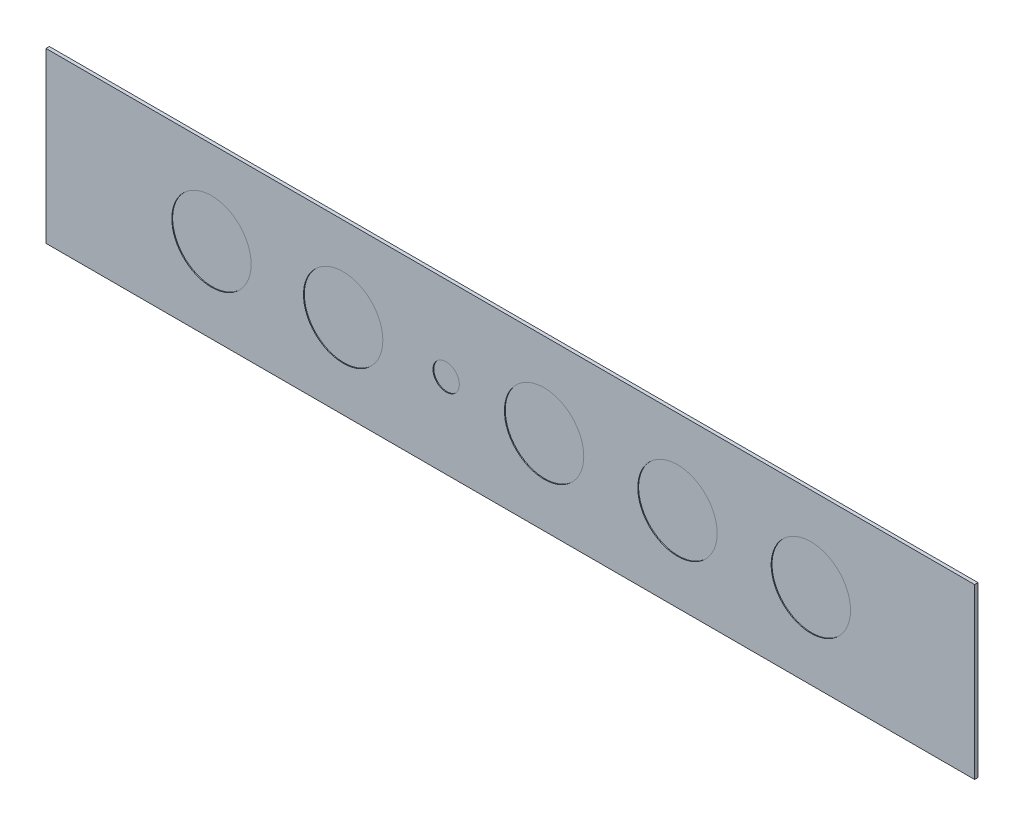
ISO-10303-21;
HEADER;
FILE_DESCRIPTION(('STEP AP214'),'2;1');
FILE_NAME('part.step','',(''),(''),'','','');
FILE_SCHEMA(('AUTOMOTIVE_DESIGN { 1 0 10303 214 1 1 1 1 }'));
ENDSEC;
DATA;
#1=APPLICATION_CONTEXT('core data for automotive mechanical design processes');
#2=APPLICATION_PROTOCOL_DEFINITION('international standard','automotive_design',2000,#1);
#3=PRODUCT_CONTEXT('',#1,'mechanical');
#4=PRODUCT('Part','Part','',(#3));
#5=PRODUCT_RELATED_PRODUCT_CATEGORY('part','',(#4));
#6=PRODUCT_DEFINITION_FORMATION('','',#4);
#7=PRODUCT_DEFINITION_CONTEXT('part definition',#1,'design');
#8=PRODUCT_DEFINITION('design','',#6,#7);
#9=PRODUCT_DEFINITION_SHAPE('','',#8);
#10=(LENGTH_UNIT() NAMED_UNIT(*) SI_UNIT(.MILLI.,.METRE.));
#11=(NAMED_UNIT(*) PLANE_ANGLE_UNIT() SI_UNIT($,.RADIAN.));
#12=(NAMED_UNIT(*) SI_UNIT($,.STERADIAN.) SOLID_ANGLE_UNIT());
#13=UNCERTAINTY_MEASURE_WITH_UNIT(LENGTH_MEASURE(1.E-05),#10,'distance_accuracy_value','');
#14=(GEOMETRIC_REPRESENTATION_CONTEXT(3) GLOBAL_UNCERTAINTY_ASSIGNED_CONTEXT((#13)) GLOBAL_UNIT_ASSIGNED_CONTEXT((#10,
#11,#12)) REPRESENTATION_CONTEXT('',''));
#15=CARTESIAN_POINT('',(0.,0.,0.));
#16=DIRECTION('',(0.,0.,1.));
#17=DIRECTION('',(1.,0.,0.));
#18=AXIS2_PLACEMENT_3D('',#15,#16,#17);
#19=CARTESIAN_POINT('',(-69.85,12.7,0.508));
#20=DIRECTION('',(1.,0.,0.));
#21=DIRECTION('',(0.,0.,-1.));
#22=AXIS2_PLACEMENT_3D('',#19,#20,#21);
#23=PLANE('',#22);
#24=DIRECTION('',(0.,-1.,0.));
#25=VECTOR('',#24,1.);
#26=CARTESIAN_POINT('',(-69.85,12.7,0.));
#27=LINE('',#26,#25);
#28=CARTESIAN_POINT('',(-69.85,12.7,0.));
#29=VERTEX_POINT('',#28);
#30=CARTESIAN_POINT('',(-69.85,-12.7,0.));
#31=VERTEX_POINT('',#30);
#32=EDGE_CURVE('E95',#29,#31,#27,.T.);
#33=ORIENTED_EDGE('',*,*,#32,.T.);
#34=DIRECTION('',(0.,0.,-1.));
#35=VECTOR('',#34,1.);
#36=CARTESIAN_POINT('',(-69.85,-12.7,0.508));
#37=LINE('',#36,#35);
#38=CARTESIAN_POINT('',(-69.85,-12.7,0.508));
#39=VERTEX_POINT('',#38);
#40=EDGE_CURVE('E11',#39,#31,#37,.T.);
#41=ORIENTED_EDGE('',*,*,#40,.F.);
#42=DIRECTION('',(0.,-1.,0.));
#43=VECTOR('',#42,1.);
#44=CARTESIAN_POINT('',(-69.85,12.7,0.508));
#45=LINE('',#44,#43);
#46=CARTESIAN_POINT('',(-69.85,12.7,0.508));
#47=VERTEX_POINT('',#46);
#48=EDGE_CURVE('E83',#47,#39,#45,.T.);
#49=ORIENTED_EDGE('',*,*,#48,.F.);
#50=DIRECTION('',(0.,0.,-1.));
#51=VECTOR('',#50,1.);
#52=CARTESIAN_POINT('',(-69.85,12.7,0.508));
#53=LINE('',#52,#51);
#54=EDGE_CURVE('E91',#47,#29,#53,.T.);
#55=ORIENTED_EDGE('',*,*,#54,.T.);
#56=EDGE_LOOP('',(#33,#41,#49,#55));
#57=FACE_BOUND('',#56,.T.);
#58=ADVANCED_FACE('F32',(#57),#23,.F.);
#59=CARTESIAN_POINT('',(-69.85,-12.7,0.508));
#60=DIRECTION('',(0.,1.,0.));
#61=DIRECTION('',(-1.,0.,0.));
#62=AXIS2_PLACEMENT_3D('',#59,#60,#61);
#63=PLANE('',#62);
#64=DIRECTION('',(1.,0.,0.));
#65=VECTOR('',#64,1.);
#66=CARTESIAN_POINT('',(-69.85,-12.7,0.));
#67=LINE('',#66,#65);
#68=CARTESIAN_POINT('',(69.85,-12.7,0.));
#69=VERTEX_POINT('',#68);
#70=EDGE_CURVE('E87',#31,#69,#67,.T.);
#71=ORIENTED_EDGE('',*,*,#70,.T.);
#72=DIRECTION('',(0.,0.,-1.));
#73=VECTOR('',#72,1.);
#74=CARTESIAN_POINT('',(69.85,-12.7,0.508));
#75=LINE('',#74,#73);
#76=CARTESIAN_POINT('',(69.85,-12.7,0.508));
#77=VERTEX_POINT('',#76);
#78=EDGE_CURVE('E40',#77,#69,#75,.T.);
#79=ORIENTED_EDGE('',*,*,#78,.F.);
#80=DIRECTION('',(1.,0.,0.));
#81=VECTOR('',#80,1.);
#82=CARTESIAN_POINT('',(-69.85,-12.7,0.508));
#83=LINE('',#82,#81);
#84=EDGE_CURVE('E78',#39,#77,#83,.T.);
#85=ORIENTED_EDGE('',*,*,#84,.F.);
#86=ORIENTED_EDGE('',*,*,#40,.T.);
#87=EDGE_LOOP('',(#71,#79,#85,#86));
#88=FACE_BOUND('',#87,.T.);
#89=ADVANCED_FACE('F86',(#88),#63,.F.);
#90=CARTESIAN_POINT('',(69.85,12.7,0.508));
#91=DIRECTION('',(-1.,0.,0.));
#92=DIRECTION('',(0.,0.,1.));
#93=AXIS2_PLACEMENT_3D('',#90,#91,#92);
#94=PLANE('',#93);
#95=DIRECTION('',(0.,1.,0.));
#96=VECTOR('',#95,1.);
#97=CARTESIAN_POINT('',(69.85,12.7,0.));
#98=LINE('',#97,#96);
#99=CARTESIAN_POINT('',(69.85,12.7,0.));
#100=VERTEX_POINT('',#99);
#101=EDGE_CURVE('E65',#69,#100,#98,.T.);
#102=ORIENTED_EDGE('',*,*,#101,.T.);
#103=DIRECTION('',(0.,0.,-1.));
#104=VECTOR('',#103,1.);
#105=CARTESIAN_POINT('',(69.85,12.7,0.508));
#106=LINE('',#105,#104);
#107=CARTESIAN_POINT('',(69.85,12.7,0.508));
#108=VERTEX_POINT('',#107);
#109=EDGE_CURVE('E88',#108,#100,#106,.T.);
#110=ORIENTED_EDGE('',*,*,#109,.F.);
#111=DIRECTION('',(0.,1.,0.));
#112=VECTOR('',#111,1.);
#113=CARTESIAN_POINT('',(69.85,12.7,0.508));
#114=LINE('',#113,#112);
#115=EDGE_CURVE('E81',#77,#108,#114,.T.);
#116=ORIENTED_EDGE('',*,*,#115,.F.);
#117=ORIENTED_EDGE('',*,*,#78,.T.);
#118=EDGE_LOOP('',(#102,#110,#116,#117));
#119=FACE_BOUND('',#118,.T.);
#120=ADVANCED_FACE('F89',(#119),#94,.F.);
#121=CARTESIAN_POINT('',(-69.85,12.7,0.508));
#122=DIRECTION('',(0.,-1.,0.));
#123=DIRECTION('',(1.,0.,0.));
#124=AXIS2_PLACEMENT_3D('',#121,#122,#123);
#125=PLANE('',#124);
#126=DIRECTION('',(-1.,0.,0.));
#127=VECTOR('',#126,1.);
#128=CARTESIAN_POINT('',(-69.85,12.7,0.));
#129=LINE('',#128,#127);
#130=EDGE_CURVE('E71',#100,#29,#129,.T.);
#131=ORIENTED_EDGE('',*,*,#130,.T.);
#132=ORIENTED_EDGE('',*,*,#54,.F.);
#133=DIRECTION('',(-1.,0.,0.));
#134=VECTOR('',#133,1.);
#135=CARTESIAN_POINT('',(-69.85,12.7,0.508));
#136=LINE('',#135,#134);
#137=EDGE_CURVE('E48',#108,#47,#136,.T.);
#138=ORIENTED_EDGE('',*,*,#137,.F.);
#139=ORIENTED_EDGE('',*,*,#109,.T.);
#140=EDGE_LOOP('',(#131,#132,#138,#139));
#141=FACE_BOUND('',#140,.T.);
#142=ADVANCED_FACE('F103',(#141),#125,.F.);
#143=CARTESIAN_POINT('',(0.,0.,0.508));
#144=DIRECTION('',(0.,0.,1.));
#145=DIRECTION('',(1.,0.,0.));
#146=AXIS2_PLACEMENT_3D('',#143,#144,#145);
#147=PLANE('',#146);
#148=CARTESIAN_POINT('',(-44.958,0.,0.508));
#149=DIRECTION('',(0.,0.,1.));
#150=DIRECTION('',(1.,0.,0.));
#151=AXIS2_PLACEMENT_3D('',#148,#149,#150);
#152=CIRCLE('',#151,5.969);
#153=CARTESIAN_POINT('',(-38.989,0.,0.508));
#154=VERTEX_POINT('',#153);
#155=EDGE_CURVE('E139',#154,#154,#152,.T.);
#156=ORIENTED_EDGE('',*,*,#155,.F.);
#157=EDGE_LOOP('',(#156));
#158=FACE_BOUND('',#157,.T.);
#159=CARTESIAN_POINT('',(-25.146,0.,0.508));
#160=DIRECTION('',(0.,0.,1.));
#161=DIRECTION('',(1.,0.,0.));
#162=AXIS2_PLACEMENT_3D('',#159,#160,#161);
#163=CIRCLE('',#162,5.969);
#164=CARTESIAN_POINT('',(-19.177,0.,0.508));
#165=VERTEX_POINT('',#164);
#166=EDGE_CURVE('E133',#165,#165,#163,.T.);
#167=ORIENTED_EDGE('',*,*,#166,.F.);
#168=EDGE_LOOP('',(#167));
#169=FACE_BOUND('',#168,.T.);
#170=CARTESIAN_POINT('',(-9.652,0.,0.508));
#171=DIRECTION('',(0.,0.,1.));
#172=DIRECTION('',(1.,0.,0.));
#173=AXIS2_PLACEMENT_3D('',#170,#171,#172);
#174=CIRCLE('',#173,1.9812);
#175=CARTESIAN_POINT('',(-7.6708,0.,0.508));
#176=VERTEX_POINT('',#175);
#177=EDGE_CURVE('E127',#176,#176,#174,.T.);
#178=ORIENTED_EDGE('',*,*,#177,.F.);
#179=EDGE_LOOP('',(#178));
#180=FACE_BOUND('',#179,.T.);
#181=CARTESIAN_POINT('',(5.08,0.,0.508));
#182=DIRECTION('',(0.,0.,1.));
#183=DIRECTION('',(1.,0.,0.));
#184=AXIS2_PLACEMENT_3D('',#181,#182,#183);
#185=CIRCLE('',#184,5.969);
#186=CARTESIAN_POINT('',(11.049,0.,0.508));
#187=VERTEX_POINT('',#186);
#188=EDGE_CURVE('E121',#187,#187,#185,.T.);
#189=ORIENTED_EDGE('',*,*,#188,.F.);
#190=EDGE_LOOP('',(#189));
#191=FACE_BOUND('',#190,.T.);
#192=CARTESIAN_POINT('',(25.146,0.,0.508));
#193=DIRECTION('',(0.,0.,1.));
#194=DIRECTION('',(1.,0.,0.));
#195=AXIS2_PLACEMENT_3D('',#192,#193,#194);
#196=CIRCLE('',#195,5.969);
#197=CARTESIAN_POINT('',(31.115,0.,0.508));
#198=VERTEX_POINT('',#197);
#199=EDGE_CURVE('E115',#198,#198,#196,.T.);
#200=ORIENTED_EDGE('',*,*,#199,.F.);
#201=EDGE_LOOP('',(#200));
#202=FACE_BOUND('',#201,.T.);
#203=CARTESIAN_POINT('',(45.212,0.,0.508));
#204=DIRECTION('',(0.,0.,1.));
#205=DIRECTION('',(1.,0.,0.));
#206=AXIS2_PLACEMENT_3D('',#203,#204,#205);
#207=CIRCLE('',#206,5.969);
#208=CARTESIAN_POINT('',(51.181,0.,0.508));
#209=VERTEX_POINT('',#208);
#210=EDGE_CURVE('E109',#209,#209,#207,.T.);
#211=ORIENTED_EDGE('',*,*,#210,.F.);
#212=EDGE_LOOP('',(#211));
#213=FACE_BOUND('',#212,.T.);
#214=ORIENTED_EDGE('',*,*,#48,.T.);
#215=ORIENTED_EDGE('',*,*,#84,.T.);
#216=ORIENTED_EDGE('',*,*,#115,.T.);
#217=ORIENTED_EDGE('',*,*,#137,.T.);
#218=EDGE_LOOP('',(#214,#215,#216,#217));
#219=FACE_BOUND('',#218,.T.);
#220=ADVANCED_FACE('F79',(#158,#169,#180,#191,#202,#213,#219),#147,.T.);
#221=CARTESIAN_POINT('',(0.,0.,0.));
#222=DIRECTION('',(0.,0.,1.));
#223=DIRECTION('',(1.,0.,0.));
#224=AXIS2_PLACEMENT_3D('',#221,#222,#223);
#225=PLANE('',#224);
#226=ORIENTED_EDGE('',*,*,#32,.F.);
#227=ORIENTED_EDGE('',*,*,#130,.F.);
#228=ORIENTED_EDGE('',*,*,#101,.F.);
#229=ORIENTED_EDGE('',*,*,#70,.F.);
#230=EDGE_LOOP('',(#226,#227,#228,#229));
#231=FACE_BOUND('',#230,.T.);
#232=ADVANCED_FACE('F106',(#231),#225,.F.);
#233=CARTESIAN_POINT('',(45.212,0.,0.381));
#234=DIRECTION('',(0.,0.,1.));
#235=DIRECTION('',(1.,0.,0.));
#236=AXIS2_PLACEMENT_3D('',#233,#234,#235);
#237=CYLINDRICAL_SURFACE('',#236,5.969);
#238=CARTESIAN_POINT('',(45.212,0.,0.381));
#239=DIRECTION('',(0.,0.,1.));
#240=DIRECTION('',(1.,0.,0.));
#241=AXIS2_PLACEMENT_3D('',#238,#239,#240);
#242=CIRCLE('',#241,5.969);
#243=CARTESIAN_POINT('',(51.181,0.,0.381));
#244=VERTEX_POINT('',#243);
#245=EDGE_CURVE('E112',#244,#244,#242,.T.);
#246=ORIENTED_EDGE('',*,*,#245,.F.);
#247=EDGE_LOOP('',(#246));
#248=FACE_BOUND('',#247,.T.);
#249=ORIENTED_EDGE('',*,*,#210,.T.);
#250=EDGE_LOOP('',(#249));
#251=FACE_BOUND('',#250,.T.);
#252=ADVANCED_FACE('F167',(#248,#251),#237,.F.);
#253=CARTESIAN_POINT('',(45.212,0.,0.381));
#254=DIRECTION('',(0.,0.,1.));
#255=DIRECTION('',(1.,0.,0.));
#256=AXIS2_PLACEMENT_3D('',#253,#254,#255);
#257=PLANE('',#256);
#258=ORIENTED_EDGE('',*,*,#245,.T.);
#259=EDGE_LOOP('',(#258));
#260=FACE_BOUND('',#259,.T.);
#261=ADVANCED_FACE('F169',(#260),#257,.T.);
#262=CARTESIAN_POINT('',(25.146,0.,0.381));
#263=DIRECTION('',(0.,0.,1.));
#264=DIRECTION('',(1.,0.,0.));
#265=AXIS2_PLACEMENT_3D('',#262,#263,#264);
#266=CYLINDRICAL_SURFACE('',#265,5.969);
#267=CARTESIAN_POINT('',(25.146,0.,0.381));
#268=DIRECTION('',(0.,0.,1.));
#269=DIRECTION('',(1.,0.,0.));
#270=AXIS2_PLACEMENT_3D('',#267,#268,#269);
#271=CIRCLE('',#270,5.969);
#272=CARTESIAN_POINT('',(31.115,0.,0.381));
#273=VERTEX_POINT('',#272);
#274=EDGE_CURVE('E118',#273,#273,#271,.T.);
#275=ORIENTED_EDGE('',*,*,#274,.F.);
#276=EDGE_LOOP('',(#275));
#277=FACE_BOUND('',#276,.T.);
#278=ORIENTED_EDGE('',*,*,#199,.T.);
#279=EDGE_LOOP('',(#278));
#280=FACE_BOUND('',#279,.T.);
#281=ADVANCED_FACE('F176',(#277,#280),#266,.F.);
#282=CARTESIAN_POINT('',(25.146,0.,0.381));
#283=DIRECTION('',(0.,0.,1.));
#284=DIRECTION('',(1.,0.,0.));
#285=AXIS2_PLACEMENT_3D('',#282,#283,#284);
#286=PLANE('',#285);
#287=ORIENTED_EDGE('',*,*,#274,.T.);
#288=EDGE_LOOP('',(#287));
#289=FACE_BOUND('',#288,.T.);
#290=ADVANCED_FACE('F224',(#289),#286,.T.);
#291=CARTESIAN_POINT('',(5.08,0.,0.381));
#292=DIRECTION('',(0.,0.,1.));
#293=DIRECTION('',(1.,0.,0.));
#294=AXIS2_PLACEMENT_3D('',#291,#292,#293);
#295=CYLINDRICAL_SURFACE('',#294,5.969);
#296=CARTESIAN_POINT('',(5.08,0.,0.381));
#297=DIRECTION('',(0.,0.,1.));
#298=DIRECTION('',(1.,0.,0.));
#299=AXIS2_PLACEMENT_3D('',#296,#297,#298);
#300=CIRCLE('',#299,5.969);
#301=CARTESIAN_POINT('',(11.049,0.,0.381));
#302=VERTEX_POINT('',#301);
#303=EDGE_CURVE('E124',#302,#302,#300,.T.);
#304=ORIENTED_EDGE('',*,*,#303,.F.);
#305=EDGE_LOOP('',(#304));
#306=FACE_BOUND('',#305,.T.);
#307=ORIENTED_EDGE('',*,*,#188,.T.);
#308=EDGE_LOOP('',(#307));
#309=FACE_BOUND('',#308,.T.);
#310=ADVANCED_FACE('F233',(#306,#309),#295,.F.);
#311=CARTESIAN_POINT('',(5.08,0.,0.381));
#312=DIRECTION('',(0.,0.,1.));
#313=DIRECTION('',(1.,0.,0.));
#314=AXIS2_PLACEMENT_3D('',#311,#312,#313);
#315=PLANE('',#314);
#316=ORIENTED_EDGE('',*,*,#303,.T.);
#317=EDGE_LOOP('',(#316));
#318=FACE_BOUND('',#317,.T.);
#319=ADVANCED_FACE('F242',(#318),#315,.T.);
#320=CARTESIAN_POINT('',(-9.652,0.,0.381));
#321=DIRECTION('',(0.,0.,1.));
#322=DIRECTION('',(1.,0.,0.));
#323=AXIS2_PLACEMENT_3D('',#320,#321,#322);
#324=CYLINDRICAL_SURFACE('',#323,1.9812);
#325=CARTESIAN_POINT('',(-9.652,0.,0.381));
#326=DIRECTION('',(0.,0.,1.));
#327=DIRECTION('',(1.,0.,0.));
#328=AXIS2_PLACEMENT_3D('',#325,#326,#327);
#329=CIRCLE('',#328,1.9812);
#330=CARTESIAN_POINT('',(-7.6708,0.,0.381));
#331=VERTEX_POINT('',#330);
#332=EDGE_CURVE('E130',#331,#331,#329,.T.);
#333=ORIENTED_EDGE('',*,*,#332,.F.);
#334=EDGE_LOOP('',(#333));
#335=FACE_BOUND('',#334,.T.);
#336=ORIENTED_EDGE('',*,*,#177,.T.);
#337=EDGE_LOOP('',(#336));
#338=FACE_BOUND('',#337,.T.);
#339=ADVANCED_FACE('F251',(#335,#338),#324,.F.);
#340=CARTESIAN_POINT('',(-9.652,0.,0.381));
#341=DIRECTION('',(0.,0.,1.));
#342=DIRECTION('',(1.,0.,0.));
#343=AXIS2_PLACEMENT_3D('',#340,#341,#342);
#344=PLANE('',#343);
#345=ORIENTED_EDGE('',*,*,#332,.T.);
#346=EDGE_LOOP('',(#345));
#347=FACE_BOUND('',#346,.T.);
#348=ADVANCED_FACE('F260',(#347),#344,.T.);
#349=CARTESIAN_POINT('',(-25.146,0.,0.381));
#350=DIRECTION('',(0.,0.,1.));
#351=DIRECTION('',(1.,0.,0.));
#352=AXIS2_PLACEMENT_3D('',#349,#350,#351);
#353=CYLINDRICAL_SURFACE('',#352,5.969);
#354=CARTESIAN_POINT('',(-25.146,0.,0.381));
#355=DIRECTION('',(0.,0.,1.));
#356=DIRECTION('',(1.,0.,0.));
#357=AXIS2_PLACEMENT_3D('',#354,#355,#356);
#358=CIRCLE('',#357,5.969);
#359=CARTESIAN_POINT('',(-19.177,0.,0.381));
#360=VERTEX_POINT('',#359);
#361=EDGE_CURVE('E136',#360,#360,#358,.T.);
#362=ORIENTED_EDGE('',*,*,#361,.F.);
#363=EDGE_LOOP('',(#362));
#364=FACE_BOUND('',#363,.T.);
#365=ORIENTED_EDGE('',*,*,#166,.T.);
#366=EDGE_LOOP('',(#365));
#367=FACE_BOUND('',#366,.T.);
#368=ADVANCED_FACE('F269',(#364,#367),#353,.F.);
#369=CARTESIAN_POINT('',(-25.146,0.,0.381));
#370=DIRECTION('',(0.,0.,1.));
#371=DIRECTION('',(1.,0.,0.));
#372=AXIS2_PLACEMENT_3D('',#369,#370,#371);
#373=PLANE('',#372);
#374=ORIENTED_EDGE('',*,*,#361,.T.);
#375=EDGE_LOOP('',(#374));
#376=FACE_BOUND('',#375,.T.);
#377=ADVANCED_FACE('F150',(#376),#373,.T.);
#378=CARTESIAN_POINT('',(-44.958,0.,0.381));
#379=DIRECTION('',(0.,0.,1.));
#380=DIRECTION('',(1.,0.,0.));
#381=AXIS2_PLACEMENT_3D('',#378,#379,#380);
#382=CYLINDRICAL_SURFACE('',#381,5.969);
#383=CARTESIAN_POINT('',(-44.958,0.,0.381));
#384=DIRECTION('',(0.,0.,1.));
#385=DIRECTION('',(1.,0.,0.));
#386=AXIS2_PLACEMENT_3D('',#383,#384,#385);
#387=CIRCLE('',#386,5.969);
#388=CARTESIAN_POINT('',(-38.989,0.,0.381));
#389=VERTEX_POINT('',#388);
#390=EDGE_CURVE('E98',#389,#389,#387,.T.);
#391=ORIENTED_EDGE('',*,*,#390,.F.);
#392=EDGE_LOOP('',(#391));
#393=FACE_BOUND('',#392,.T.);
#394=ORIENTED_EDGE('',*,*,#155,.T.);
#395=EDGE_LOOP('',(#394));
#396=FACE_BOUND('',#395,.T.);
#397=ADVANCED_FACE('F147',(#393,#396),#382,.F.);
#398=CARTESIAN_POINT('',(-44.958,0.,0.381));
#399=DIRECTION('',(0.,0.,1.));
#400=DIRECTION('',(1.,0.,0.));
#401=AXIS2_PLACEMENT_3D('',#398,#399,#400);
#402=PLANE('',#401);
#403=ORIENTED_EDGE('',*,*,#390,.T.);
#404=EDGE_LOOP('',(#403));
#405=FACE_BOUND('',#404,.T.);
#406=ADVANCED_FACE('F145',(#405),#402,.T.);
#407=CLOSED_SHELL('',(#58,#89,#120,#142,#220,#232,#252,#261,#281,#290,#310,#319,#339,#348,#368,
#377,#397,#406));
#408=MANIFOLD_SOLID_BREP('B2',#407);
#409=ADVANCED_BREP_SHAPE_REPRESENTATION('',(#18,#408),#14);
#410=SHAPE_DEFINITION_REPRESENTATION(#9,#409);
ENDSEC;
END-ISO-10303-21;
